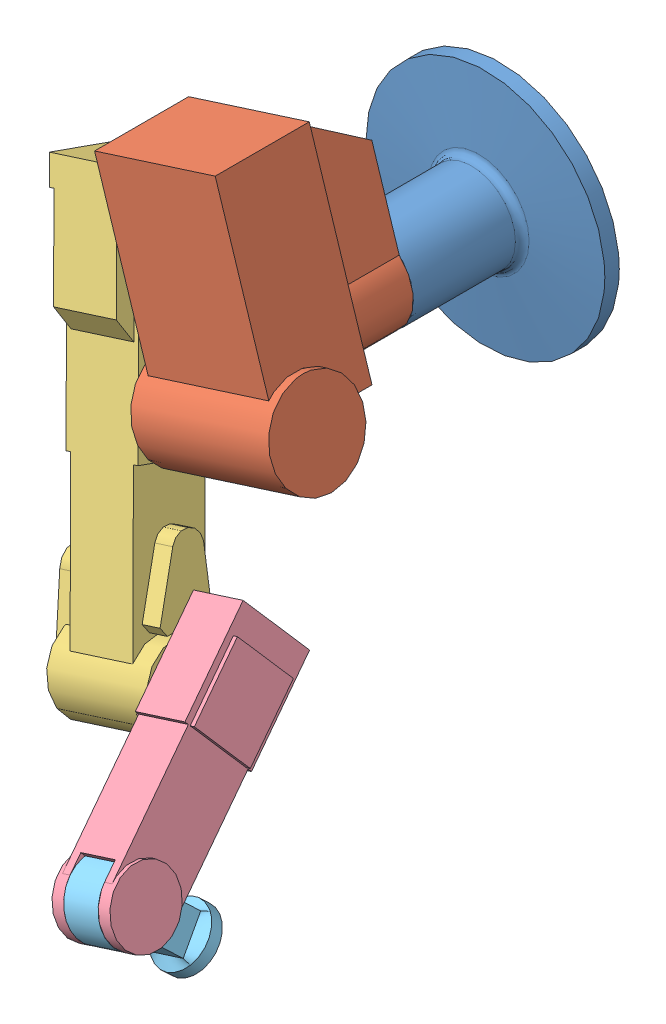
SolidWorks assembly 00Robot.SLDASM, configuration Default (file format 3100). Lengths in mm.
Overall size (469.4 836.02 721.75).
8 component instances, 7 part files, 23 mates.
Components (placement in the parent):
- 01Base-1: 01Base.SLDPRT [Default] x (0 1 0) z (1 0 0) size (330 230 330)
- 02Cuerpo-2: 02Cuerpo.SLDPRT [Default] at (0 0 180) x (0.304132 -0.95263 0) z (-0.95263 -0.304132 0) size (359 253.5 256.5)
- 03BrazoA-1: 03BrazoA.SLDPRT [Default] at (-201.8007 106.833 297.0365) x (-0.089698 0.280961 0.955518) z (-0.290604 0.910255 -0.294932) size (141.5 208 578)
- 04BrazoB-4: 04BrazoB.SLDPRT [Default] at (44.0717 -286.8293 387.2906) x (0.238449 -0.74689 -0.620723) z (-0.188782 0.59132 -0.78403) size (107 84 360)
- 05BrazoC-1: 05BrazoC.SLDPRT [Default] at (102.9717 -471.321 631.9079) x (0.216691 -0.67874 0.701682) z (-0.213404 0.668443 0.71249) size (96 89.73 159)
- 06Punta-1: 06Punta.SLDPRT [Default] at (126.6595 -545.5182 552.8215) x (-0.95263 -0.304132 0) z (0.216691 -0.67874 0.701682) size (120 114 120) (hidden)
- 07Pinzas-1: 07Pinzas.SLDPRT [Default] at (134.3561 -601.0354 431.4709) x (0.95263 0.304132 0) z (0.213404 -0.668443 -0.71249) size (36.09 5 51.09) (hidden)
- 07Pinzas-2: 07Pinzas.SLDPRT [Default] at (172.4051 -657.3975 495.7449) x (-0.95263 -0.304132 0) z (0.213404 -0.668443 -0.71249) size (36.09 5 51.09) (hidden)
Mates (geometry in assembly coordinates):
- Concentric1: concentric aligned: cylinder of 01Base-1; cylinder of 02Cuerpo-2
- Concentric2: concentric aligned: cylinder of 02Cuerpo-2; cylinder of 03BrazoA-1
- Coincident4: coincident anti-aligned: plane of 01Base-1 through (0 0 230) normal (0 0 1); plane of 02Cuerpo-2 through (0 0 230) normal (0 0 -1)
- Coincident7: distance = 1 mm anti-aligned: plane of 02Cuerpo-2 through (-127.7973 -114.2808 369) normal (-0.95263 -0.304132 0); plane of 03BrazoA-1 through (-128.7499 -114.5849 369) normal (0.95263 0.304132 0)
- Concentric3: concentric aligned: cylinder of 03BrazoA-1; cylinder of 04BrazoB-4
- Coincident8: distance anti-aligned: unknown of 03BrazoA-1; unknown of 04BrazoB-4
- Concentric6: concentric aligned: cylinder of 04BrazoB-4; cylinder of 05BrazoC-1
- Coincident11: distance anti-aligned: unknown of 04BrazoB-4; unknown of 05BrazoC-1
- Concentric7: concentric aligned: cylinder of 05BrazoC-1; cylinder of 06Punta-1
- Coincident12: distance anti-aligned: unknown of 05BrazoC-1; unknown of 06Punta-1
- Concentric8: concentric aligned: cylinder of 06Punta-1; cylinder of 07Pinzas-1
- Concentric9: concentric anti-aligned: cylinder of 06Punta-1; cylinder of 07Pinzas-2
- Parallel1: parallel aligned: plane of 06Punta-1 through (132.959 -650.7392 521.4928) normal (0.213404 -0.668443 -0.71249); plane of 07Pinzas-1 through (131.5925 -609.9872 430.7909) normal (0.213404 -0.668443 -0.71249)
- Parallel2: parallel aligned: plane of 06Punta-1 through (132.959 -650.7392 521.4928) normal (0.213404 -0.668443 -0.71249); plane of 07Pinzas-2 through (177.6777 -656.3045 488.0481) normal (0.213404 -0.668443 -0.71249)
- Coincident16: distance anti-aligned: unknown of 06Punta-1; unknown of 07Pinzas-2
- Coincident19: distance anti-aligned: unknown of 06Punta-1; unknown of 07Pinzas-1
- Angulo Rotacion Encoder 5: parallel aligned: plane of 05BrazoC-1 through (140.949 -508.076 620.2552) normal (0.216691 -0.67874 0.701682); plane of 06Punta-1 through (113.9431 -617.725 532.5438) normal (0.216691 -0.67874 0.701682)
- Coincidente5: distance aligned: unknown of 01Base-1
- Coincidente6: distance aligned: unknown of 01Base-1
- Coincidente7: distance aligned: unknown of 01Base-1
- PLANO1: unknown = 0 mm: unknown of 04BrazoB-4
- Croquis4: unknown = 411.4624 mm: unknown of 05BrazoC-1; axis of 03BrazoA-1; unknown of 02Cuerpo-2; unknown of 05BrazoC-1
- PLANO2: unknown = 19 mm: unknown of 01Base-1
